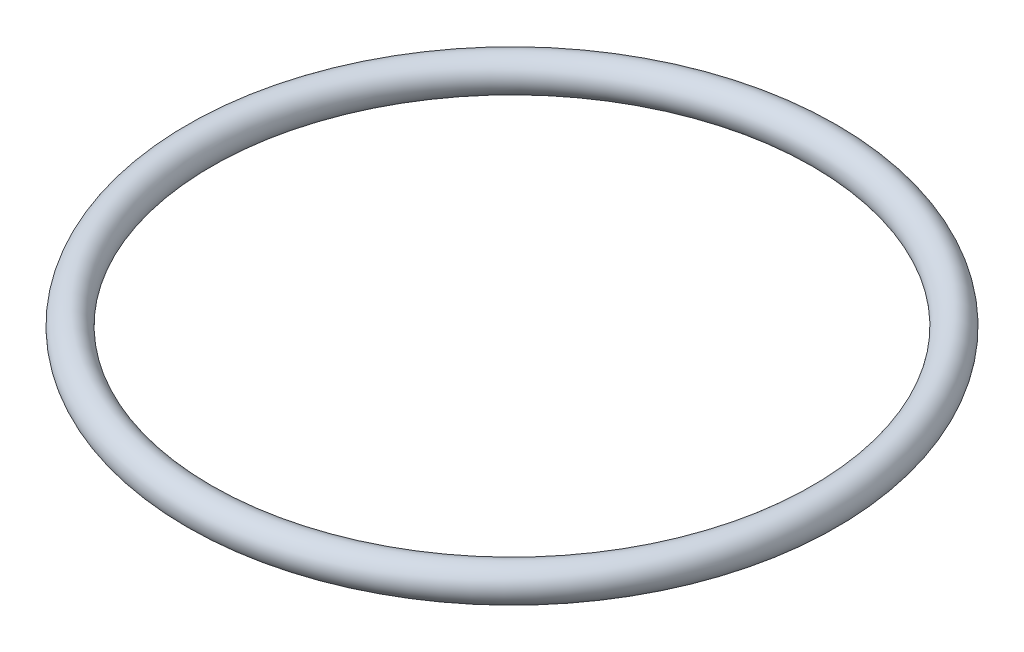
ISO-10303-21;
HEADER;
FILE_DESCRIPTION(('STEP AP214'),'2;1');
FILE_NAME('part.step','',(''),(''),'','','');
FILE_SCHEMA(('AUTOMOTIVE_DESIGN { 1 0 10303 214 1 1 1 1 }'));
ENDSEC;
DATA;
#1=APPLICATION_CONTEXT('core data for automotive mechanical design processes');
#2=APPLICATION_PROTOCOL_DEFINITION('international standard','automotive_design',2000,#1);
#3=PRODUCT_CONTEXT('',#1,'mechanical');
#4=PRODUCT('Part','Part','',(#3));
#5=PRODUCT_RELATED_PRODUCT_CATEGORY('part','',(#4));
#6=PRODUCT_DEFINITION_FORMATION('','',#4);
#7=PRODUCT_DEFINITION_CONTEXT('part definition',#1,'design');
#8=PRODUCT_DEFINITION('design','',#6,#7);
#9=PRODUCT_DEFINITION_SHAPE('','',#8);
#10=(LENGTH_UNIT() NAMED_UNIT(*) SI_UNIT(.MILLI.,.METRE.));
#11=(NAMED_UNIT(*) PLANE_ANGLE_UNIT() SI_UNIT($,.RADIAN.));
#12=(NAMED_UNIT(*) SI_UNIT($,.STERADIAN.) SOLID_ANGLE_UNIT());
#13=UNCERTAINTY_MEASURE_WITH_UNIT(LENGTH_MEASURE(1.E-05),#10,'distance_accuracy_value','');
#14=(GEOMETRIC_REPRESENTATION_CONTEXT(3) GLOBAL_UNCERTAINTY_ASSIGNED_CONTEXT((#13)) GLOBAL_UNIT_ASSIGNED_CONTEXT((#10,
#11,#12)) REPRESENTATION_CONTEXT('',''));
#15=CARTESIAN_POINT('',(0.,0.,0.));
#16=DIRECTION('',(0.,0.,1.));
#17=DIRECTION('',(1.,0.,0.));
#18=AXIS2_PLACEMENT_3D('',#15,#16,#17);
#19=CARTESIAN_POINT('',(0.,0.,0.));
#20=DIRECTION('',(0.,-1.,0.));
#21=DIRECTION('',(0.,0.,-1.));
#22=AXIS2_PLACEMENT_3D('',#19,#20,#21);
#23=TOROIDAL_SURFACE('',#22,14.7,0.799999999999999);
#24=ADVANCED_FACE('F14',(),#23,.T.);
#25=CLOSED_SHELL('',(#24));
#26=MANIFOLD_SOLID_BREP('B1',#25);
#27=ADVANCED_BREP_SHAPE_REPRESENTATION('',(#18,#26),#14);
#28=SHAPE_DEFINITION_REPRESENTATION(#9,#27);
ENDSEC;
END-ISO-10303-21;
